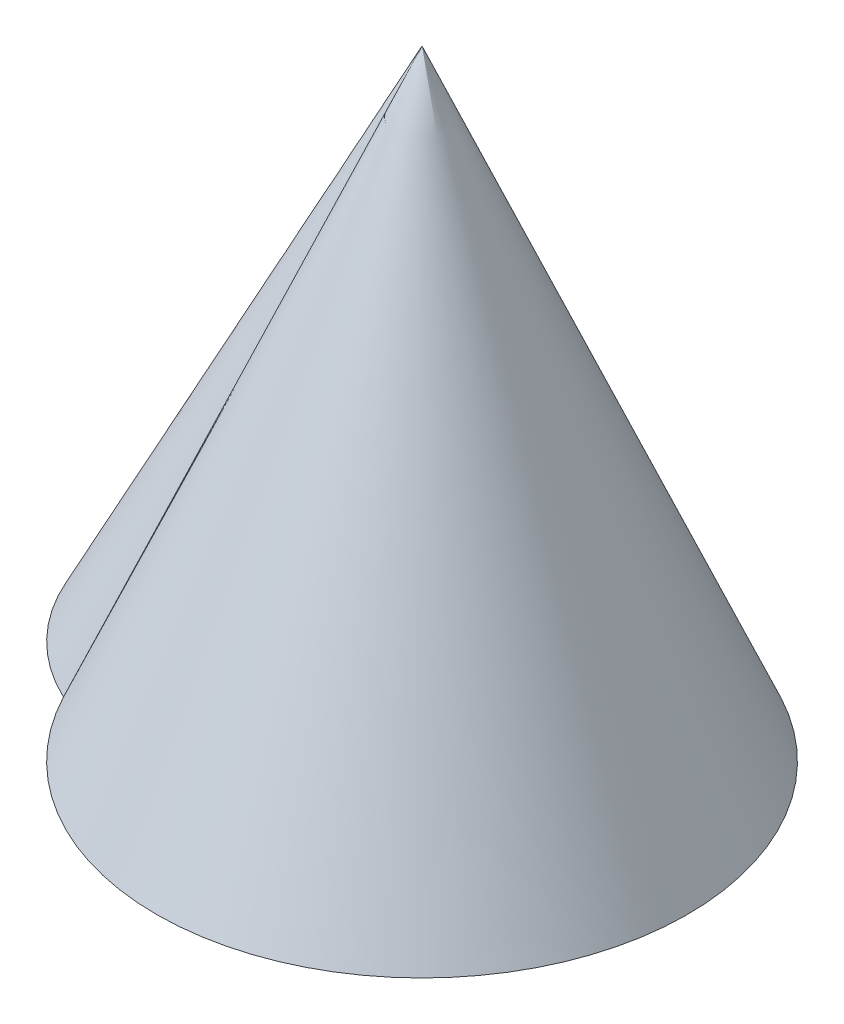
from build123d import *


with BuildPart() as part:
    # Sketch 1 → Loft 1 section 0
    with BuildSketch(Plane(origin=(0, 0, 0), x_dir=(1, 0, 0), z_dir=(0, 1, 0)), mode=Mode.PRIVATE) as loft_1_s0:
        with BuildLine():
            ThreePointArc((-26.54651857, -13.974346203), (28.076277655, -10.569892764), (-10.740031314, 28.011635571))
            ThreePointArc((-10.740031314, 28.011635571), (-38.057208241, 14.327419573), (-26.54651857, -13.974346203))
        make_face()
    loft([Vertex(0, 70, 0), loft_1_s0.sketch])


solid = part.part
